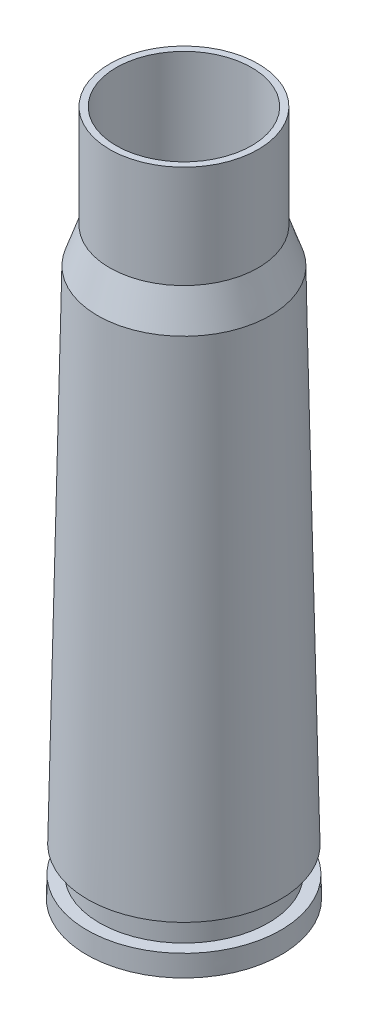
ISO-10303-21;
HEADER;
FILE_DESCRIPTION(('STEP AP214'),'2;1');
FILE_NAME('part.step','',(''),(''),'','','');
FILE_SCHEMA(('AUTOMOTIVE_DESIGN { 1 0 10303 214 1 1 1 1 }'));
ENDSEC;
DATA;
#1=APPLICATION_CONTEXT('core data for automotive mechanical design processes');
#2=APPLICATION_PROTOCOL_DEFINITION('international standard','automotive_design',2000,#1);
#3=PRODUCT_CONTEXT('',#1,'mechanical');
#4=PRODUCT('Part','Part','',(#3));
#5=PRODUCT_RELATED_PRODUCT_CATEGORY('part','',(#4));
#6=PRODUCT_DEFINITION_FORMATION('','',#4);
#7=PRODUCT_DEFINITION_CONTEXT('part definition',#1,'design');
#8=PRODUCT_DEFINITION('design','',#6,#7);
#9=PRODUCT_DEFINITION_SHAPE('','',#8);
#10=(LENGTH_UNIT() NAMED_UNIT(*) SI_UNIT(.MILLI.,.METRE.));
#11=(NAMED_UNIT(*) PLANE_ANGLE_UNIT() SI_UNIT($,.RADIAN.));
#12=(NAMED_UNIT(*) SI_UNIT($,.STERADIAN.) SOLID_ANGLE_UNIT());
#13=UNCERTAINTY_MEASURE_WITH_UNIT(LENGTH_MEASURE(1.E-05),#10,'distance_accuracy_value','');
#14=(GEOMETRIC_REPRESENTATION_CONTEXT(3) GLOBAL_UNCERTAINTY_ASSIGNED_CONTEXT((#13)) GLOBAL_UNIT_ASSIGNED_CONTEXT((#10,
#11,#12)) REPRESENTATION_CONTEXT('',''));
#15=CARTESIAN_POINT('',(0.,0.,0.));
#16=DIRECTION('',(0.,0.,1.));
#17=DIRECTION('',(1.,0.,0.));
#18=AXIS2_PLACEMENT_3D('',#15,#16,#17);
#19=CARTESIAN_POINT('',(0.,79.1275030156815,0.));
#20=DIRECTION('',(0.,-1.,0.));
#21=DIRECTION('',(0.,0.,-1.));
#22=AXIS2_PLACEMENT_3D('',#19,#20,#21);
#23=CYLINDRICAL_SURFACE('',#22,2.5);
#24=CARTESIAN_POINT('',(0.,76.6275030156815,0.));
#25=DIRECTION('',(0.,-1.,0.));
#26=DIRECTION('',(0.,0.,-1.));
#27=AXIS2_PLACEMENT_3D('',#24,#25,#26);
#28=CIRCLE('',#27,2.5);
#29=CARTESIAN_POINT('',(0.,76.6275030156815,-2.5));
#30=VERTEX_POINT('',#29);
#31=EDGE_CURVE('E87',#30,#30,#28,.F.);
#32=ORIENTED_EDGE('',*,*,#31,.T.);
#33=EDGE_LOOP('',(#32));
#34=FACE_BOUND('',#33,.T.);
#35=CARTESIAN_POINT('',(0.,79.1275030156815,0.));
#36=DIRECTION('',(0.,-1.,0.));
#37=DIRECTION('',(0.,0.,-1.));
#38=AXIS2_PLACEMENT_3D('',#35,#36,#37);
#39=CIRCLE('',#38,2.5);
#40=CARTESIAN_POINT('',(0.,79.1275030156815,-2.5));
#41=VERTEX_POINT('',#40);
#42=EDGE_CURVE('E18',#41,#41,#39,.F.);
#43=ORIENTED_EDGE('',*,*,#42,.F.);
#44=EDGE_LOOP('',(#43));
#45=FACE_BOUND('',#44,.T.);
#46=ADVANCED_FACE('F15',(#34,#45),#23,.T.);
#47=CARTESIAN_POINT('',(0.,79.1275030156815,0.));
#48=DIRECTION('',(0.,1.,0.));
#49=DIRECTION('',(0.,0.,1.));
#50=AXIS2_PLACEMENT_3D('',#47,#48,#49);
#51=PLANE('',#50);
#52=CARTESIAN_POINT('',(0.,79.1275030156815,0.));
#53=DIRECTION('',(0.,1.,0.));
#54=DIRECTION('',(0.,0.,1.));
#55=AXIS2_PLACEMENT_3D('',#52,#53,#54);
#56=CIRCLE('',#55,2.25);
#57=CARTESIAN_POINT('',(0.,79.1275030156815,2.25));
#58=VERTEX_POINT('',#57);
#59=EDGE_CURVE('E85',#58,#58,#56,.F.);
#60=ORIENTED_EDGE('',*,*,#59,.T.);
#61=EDGE_LOOP('',(#60));
#62=FACE_BOUND('',#61,.T.);
#63=ORIENTED_EDGE('',*,*,#42,.T.);
#64=EDGE_LOOP('',(#63));
#65=FACE_BOUND('',#64,.T.);
#66=ADVANCED_FACE('F94',(#62,#65),#51,.T.);
#67=CARTESIAN_POINT('',(0.,76.6275030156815,3.92966095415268));
#68=DIRECTION('',(0.,-1.,0.));
#69=DIRECTION('',(0.,0.,-1.));
#70=AXIS2_PLACEMENT_3D('',#67,#68,#69);
#71=PLANE('',#70);
#72=ORIENTED_EDGE('',*,*,#31,.F.);
#73=EDGE_LOOP('',(#72));
#74=FACE_BOUND('',#73,.T.);
#75=CARTESIAN_POINT('',(0.,76.6275030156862,0.));
#76=DIRECTION('',(0.,1.,0.));
#77=DIRECTION('',(0.,0.,1.));
#78=AXIS2_PLACEMENT_3D('',#75,#76,#77);
#79=CIRCLE('',#78,3.92966095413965);
#80=CARTESIAN_POINT('',(0.,76.6275030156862,3.92966095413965));
#81=VERTEX_POINT('',#80);
#82=EDGE_CURVE('E82',#81,#81,#79,.T.);
#83=ORIENTED_EDGE('',*,*,#82,.T.);
#84=EDGE_LOOP('',(#83));
#85=FACE_BOUND('',#84,.T.);
#86=ADVANCED_FACE('F101',(#74,#85),#71,.F.);
#87=CARTESIAN_POINT('',(0.,74.8275030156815,0.));
#88=DIRECTION('',(0.,1.,0.));
#89=DIRECTION('',(0.,0.,1.));
#90=AXIS2_PLACEMENT_3D('',#87,#88,#89);
#91=CYLINDRICAL_SURFACE('',#90,2.25);
#92=CARTESIAN_POINT('',(0.,75.0275030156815,0.));
#93=DIRECTION('',(0.,1.,0.));
#94=DIRECTION('',(0.,0.,1.));
#95=AXIS2_PLACEMENT_3D('',#92,#93,#94);
#96=CIRCLE('',#95,2.25);
#97=CARTESIAN_POINT('',(0.,75.0275030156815,2.25));
#98=VERTEX_POINT('',#97);
#99=EDGE_CURVE('E60',#98,#98,#96,.T.);
#100=ORIENTED_EDGE('',*,*,#99,.F.);
#101=EDGE_LOOP('',(#100));
#102=FACE_BOUND('',#101,.T.);
#103=ORIENTED_EDGE('',*,*,#59,.F.);
#104=EDGE_LOOP('',(#103));
#105=FACE_BOUND('',#104,.T.);
#106=ADVANCED_FACE('F165',(#102,#105),#91,.F.);
#107=CARTESIAN_POINT('',(0.,78.1131638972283,0.));
#108=DIRECTION('',(0.,1.,0.));
#109=DIRECTION('',(0.,0.,1.));
#110=AXIS2_PLACEMENT_3D('',#107,#108,#109);
#111=CONICAL_SURFACE('',#110,4.28325681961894,0.233658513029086);
#112=CARTESIAN_POINT('',(0.,78.1131638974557,0.));
#113=DIRECTION('',(0.,1.,0.));
#114=DIRECTION('',(0.,0.,-1.));
#115=AXIS2_PLACEMENT_3D('',#112,#113,#114);
#116=CIRCLE('',#115,4.28325681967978);
#117=CARTESIAN_POINT('',(0.,78.1131638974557,-4.28325681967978));
#118=VERTEX_POINT('',#117);
#119=EDGE_CURVE('E57',#118,#118,#116,.T.);
#120=ORIENTED_EDGE('',*,*,#119,.T.);
#121=EDGE_LOOP('',(#120));
#122=FACE_BOUND('',#121,.T.);
#123=ORIENTED_EDGE('',*,*,#82,.F.);
#124=EDGE_LOOP('',(#123));
#125=FACE_BOUND('',#124,.T.);
#126=ADVANCED_FACE('F161',(#122,#125),#111,.F.);
#127=CARTESIAN_POINT('',(0.,75.0275030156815,0.));
#128=DIRECTION('',(0.,-1.,0.));
#129=DIRECTION('',(0.,0.,-1.));
#130=AXIS2_PLACEMENT_3D('',#127,#128,#129);
#131=PLANE('',#130);
#132=ORIENTED_EDGE('',*,*,#99,.T.);
#133=EDGE_LOOP('',(#132));
#134=FACE_BOUND('',#133,.T.);
#135=CARTESIAN_POINT('',(0.,75.0275030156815,0.));
#136=DIRECTION('',(0.,-1.,0.));
#137=DIRECTION('',(0.,0.,-1.));
#138=AXIS2_PLACEMENT_3D('',#135,#136,#137);
#139=CIRCLE('',#138,2.35);
#140=CARTESIAN_POINT('',(0.,75.0275030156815,-2.35));
#141=VERTEX_POINT('',#140);
#142=EDGE_CURVE('E54',#141,#141,#139,.T.);
#143=ORIENTED_EDGE('',*,*,#142,.T.);
#144=EDGE_LOOP('',(#143));
#145=FACE_BOUND('',#144,.T.);
#146=ADVANCED_FACE('F157',(#134,#145),#131,.T.);
#147=CARTESIAN_POINT('',(0.,105.989545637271,0.));
#148=DIRECTION('',(0.,1.,0.));
#149=DIRECTION('',(0.,0.,1.));
#150=AXIS2_PLACEMENT_3D('',#147,#148,#149);
#151=CONICAL_SURFACE('',#150,4.38056414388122,0.00349065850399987);
#152=CARTESIAN_POINT('',(0.,105.989545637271,0.));
#153=DIRECTION('',(0.,-1.,0.));
#154=DIRECTION('',(0.,0.,1.));
#155=AXIS2_PLACEMENT_3D('',#152,#153,#154);
#156=CIRCLE('',#155,4.38056414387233);
#157=CARTESIAN_POINT('',(0.,105.989545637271,4.38056414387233));
#158=VERTEX_POINT('',#157);
#159=EDGE_CURVE('E51',#158,#158,#156,.F.);
#160=ORIENTED_EDGE('',*,*,#159,.T.);
#161=EDGE_LOOP('',(#160));
#162=FACE_BOUND('',#161,.T.);
#163=ORIENTED_EDGE('',*,*,#119,.F.);
#164=EDGE_LOOP('',(#163));
#165=FACE_BOUND('',#164,.T.);
#166=ADVANCED_FACE('F153',(#162,#165),#151,.F.);
#167=CARTESIAN_POINT('',(0.,75.0275030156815,0.));
#168=DIRECTION('',(0.,-1.,0.));
#169=DIRECTION('',(0.,0.,-1.));
#170=AXIS2_PLACEMENT_3D('',#167,#168,#169);
#171=CYLINDRICAL_SURFACE('',#170,2.35);
#172=CARTESIAN_POINT('',(0.,74.8275030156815,0.));
#173=DIRECTION('',(0.,-1.,0.));
#174=DIRECTION('',(0.,0.,-1.));
#175=AXIS2_PLACEMENT_3D('',#172,#173,#174);
#176=CIRCLE('',#175,2.35);
#177=CARTESIAN_POINT('',(0.,74.8275030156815,-2.35));
#178=VERTEX_POINT('',#177);
#179=EDGE_CURVE('E48',#178,#178,#176,.T.);
#180=ORIENTED_EDGE('',*,*,#179,.T.);
#181=EDGE_LOOP('',(#180));
#182=FACE_BOUND('',#181,.T.);
#183=ORIENTED_EDGE('',*,*,#142,.F.);
#184=EDGE_LOOP('',(#183));
#185=FACE_BOUND('',#184,.T.);
#186=ADVANCED_FACE('F149',(#182,#185),#171,.F.);
#187=CARTESIAN_POINT('',(0.,105.989545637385,0.));
#188=DIRECTION('',(0.,-1.,0.));
#189=DIRECTION('',(0.,0.,-1.));
#190=AXIS2_PLACEMENT_3D('',#187,#188,#189);
#191=CONICAL_SURFACE('',#190,4.38056414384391,0.329272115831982);
#192=CARTESIAN_POINT('',(0.,107.540333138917,0.));
#193=DIRECTION('',(0.,1.,0.));
#194=DIRECTION('',(0.,0.,1.));
#195=AXIS2_PLACEMENT_3D('',#192,#193,#194);
#196=CIRCLE('',#195,3.85064177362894);
#197=CARTESIAN_POINT('',(0.,107.540333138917,3.85064177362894));
#198=VERTEX_POINT('',#197);
#199=EDGE_CURVE('E44',#198,#198,#196,.T.);
#200=ORIENTED_EDGE('',*,*,#199,.T.);
#201=EDGE_LOOP('',(#200));
#202=FACE_BOUND('',#201,.T.);
#203=ORIENTED_EDGE('',*,*,#159,.F.);
#204=EDGE_LOOP('',(#203));
#205=FACE_BOUND('',#204,.T.);
#206=ADVANCED_FACE('F145',(#202,#205),#191,.F.);
#207=CARTESIAN_POINT('',(0.,74.8275030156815,0.));
#208=DIRECTION('',(0.,1.,0.));
#209=DIRECTION('',(0.,0.,1.));
#210=AXIS2_PLACEMENT_3D('',#207,#208,#209);
#211=PLANE('',#210);
#212=ORIENTED_EDGE('',*,*,#179,.F.);
#213=EDGE_LOOP('',(#212));
#214=FACE_BOUND('',#213,.T.);
#215=CARTESIAN_POINT('',(0.,74.8275030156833,0.));
#216=DIRECTION('',(0.,-1.,0.));
#217=DIRECTION('',(0.,0.,-1.));
#218=AXIS2_PLACEMENT_3D('',#215,#216,#217);
#219=CIRCLE('',#218,5.5347161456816);
#220=CARTESIAN_POINT('',(0.,74.8275030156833,-5.5347161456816));
#221=VERTEX_POINT('',#220);
#222=EDGE_CURVE('E47',#221,#221,#219,.F.);
#223=ORIENTED_EDGE('',*,*,#222,.F.);
#224=EDGE_LOOP('',(#223));
#225=FACE_BOUND('',#224,.T.);
#226=ADVANCED_FACE('F141',(#214,#225),#211,.F.);
#227=CARTESIAN_POINT('',(0.,74.8275030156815,0.));
#228=DIRECTION('',(0.,1.,0.));
#229=DIRECTION('',(0.,0.,1.));
#230=AXIS2_PLACEMENT_3D('',#227,#228,#229);
#231=CYLINDRICAL_SURFACE('',#230,3.85064177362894);
#232=CARTESIAN_POINT('',(0.,113.830317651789,0.));
#233=DIRECTION('',(0.,1.,0.));
#234=DIRECTION('',(0.,0.,1.));
#235=AXIS2_PLACEMENT_3D('',#232,#233,#234);
#236=CIRCLE('',#235,3.85064177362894);
#237=CARTESIAN_POINT('',(0.,113.830317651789,3.85064177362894));
#238=VERTEX_POINT('',#237);
#239=EDGE_CURVE('E71',#238,#238,#236,.T.);
#240=ORIENTED_EDGE('',*,*,#239,.T.);
#241=EDGE_LOOP('',(#240));
#242=FACE_BOUND('',#241,.T.);
#243=ORIENTED_EDGE('',*,*,#199,.F.);
#244=EDGE_LOOP('',(#243));
#245=FACE_BOUND('',#244,.T.);
#246=ADVANCED_FACE('F137',(#242,#245),#231,.F.);
#247=CARTESIAN_POINT('',(0.,74.8275030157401,0.));
#248=DIRECTION('',(0.,-1.,0.));
#249=DIRECTION('',(0.,0.,-1.));
#250=AXIS2_PLACEMENT_3D('',#247,#248,#249);
#251=CONICAL_SURFACE('',#250,5.53471614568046,0.0200783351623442);
#252=ORIENTED_EDGE('',*,*,#222,.T.);
#253=EDGE_LOOP('',(#252));
#254=FACE_BOUND('',#253,.T.);
#255=CARTESIAN_POINT('',(0.,76.0275030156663,0.));
#256=DIRECTION('',(0.,-1.,0.));
#257=DIRECTION('',(0.,0.,-1.));
#258=AXIS2_PLACEMENT_3D('',#255,#256,#257);
#259=CIRCLE('',#258,5.5106189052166);
#260=CARTESIAN_POINT('',(0.,76.0275030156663,-5.5106189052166));
#261=VERTEX_POINT('',#260);
#262=EDGE_CURVE('E68',#261,#261,#259,.T.);
#263=ORIENTED_EDGE('',*,*,#262,.T.);
#264=EDGE_LOOP('',(#263));
#265=FACE_BOUND('',#264,.T.);
#266=ADVANCED_FACE('F133',(#254,#265),#251,.T.);
#267=CARTESIAN_POINT('',(0.,113.830317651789,4.22195416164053));
#268=DIRECTION('',(0.,-1.,0.));
#269=DIRECTION('',(0.,0.,-1.));
#270=AXIS2_PLACEMENT_3D('',#267,#268,#269);
#271=PLANE('',#270);
#272=ORIENTED_EDGE('',*,*,#239,.F.);
#273=EDGE_LOOP('',(#272));
#274=FACE_BOUND('',#273,.T.);
#275=CARTESIAN_POINT('',(0.,113.830317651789,0.));
#276=DIRECTION('',(0.,1.,0.));
#277=DIRECTION('',(0.,0.,1.));
#278=AXIS2_PLACEMENT_3D('',#275,#276,#277);
#279=CIRCLE('',#278,4.22195416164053);
#280=CARTESIAN_POINT('',(0.,113.830317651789,4.22195416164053));
#281=VERTEX_POINT('',#280);
#282=EDGE_CURVE('E65',#281,#281,#279,.F.);
#283=ORIENTED_EDGE('',*,*,#282,.F.);
#284=EDGE_LOOP('',(#283));
#285=FACE_BOUND('',#284,.T.);
#286=ADVANCED_FACE('F129',(#274,#285),#271,.F.);
#287=CARTESIAN_POINT('',(0.,76.0275030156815,5.51061890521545));
#288=DIRECTION('',(0.,-1.,0.));
#289=DIRECTION('',(0.,0.,-1.));
#290=AXIS2_PLACEMENT_3D('',#287,#288,#289);
#291=PLANE('',#290);
#292=CARTESIAN_POINT('',(0.,76.0275030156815,0.));
#293=DIRECTION('',(0.,1.,0.));
#294=DIRECTION('',(0.,0.,1.));
#295=AXIS2_PLACEMENT_3D('',#292,#293,#294);
#296=CIRCLE('',#295,4.8);
#297=CARTESIAN_POINT('',(0.,76.0275030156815,4.8));
#298=VERTEX_POINT('',#297);
#299=EDGE_CURVE('E41',#298,#298,#296,.T.);
#300=ORIENTED_EDGE('',*,*,#299,.F.);
#301=EDGE_LOOP('',(#300));
#302=FACE_BOUND('',#301,.T.);
#303=ORIENTED_EDGE('',*,*,#262,.F.);
#304=EDGE_LOOP('',(#303));
#305=FACE_BOUND('',#304,.T.);
#306=ADVANCED_FACE('F125',(#302,#305),#291,.F.);
#307=CARTESIAN_POINT('',(0.,74.8275030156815,0.));
#308=DIRECTION('',(0.,1.,0.));
#309=DIRECTION('',(0.,0.,1.));
#310=AXIS2_PLACEMENT_3D('',#307,#308,#309);
#311=CYLINDRICAL_SURFACE('',#310,4.22195416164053);
#312=CARTESIAN_POINT('',(0.,108.000000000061,0.));
#313=DIRECTION('',(0.,-1.,0.));
#314=DIRECTION('',(0.,0.,1.));
#315=AXIS2_PLACEMENT_3D('',#312,#313,#314);
#316=CIRCLE('',#315,4.22195416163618);
#317=CARTESIAN_POINT('',(0.,108.000000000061,4.22195416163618));
#318=VERTEX_POINT('',#317);
#319=EDGE_CURVE('E36',#318,#318,#316,.T.);
#320=ORIENTED_EDGE('',*,*,#319,.F.);
#321=EDGE_LOOP('',(#320));
#322=FACE_BOUND('',#321,.T.);
#323=ORIENTED_EDGE('',*,*,#282,.T.);
#324=EDGE_LOOP('',(#323));
#325=FACE_BOUND('',#324,.T.);
#326=ADVANCED_FACE('F121',(#322,#325),#311,.T.);
#327=CARTESIAN_POINT('',(0.,74.8275030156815,0.));
#328=DIRECTION('',(0.,1.,0.));
#329=DIRECTION('',(0.,0.,1.));
#330=AXIS2_PLACEMENT_3D('',#327,#328,#329);
#331=CYLINDRICAL_SURFACE('',#330,4.8);
#332=ORIENTED_EDGE('',*,*,#299,.T.);
#333=EDGE_LOOP('',(#332));
#334=FACE_BOUND('',#333,.T.);
#335=CARTESIAN_POINT('',(0.,77.2275030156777,0.));
#336=DIRECTION('',(0.,1.,0.));
#337=DIRECTION('',(0.,0.,-1.));
#338=AXIS2_PLACEMENT_3D('',#335,#336,#337);
#339=CIRCLE('',#338,4.79999999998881);
#340=CARTESIAN_POINT('',(0.,77.2275030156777,-4.79999999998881));
#341=VERTEX_POINT('',#340);
#342=EDGE_CURVE('E27',#341,#341,#339,.T.);
#343=ORIENTED_EDGE('',*,*,#342,.F.);
#344=EDGE_LOOP('',(#343));
#345=FACE_BOUND('',#344,.T.);
#346=ADVANCED_FACE('F117',(#334,#345),#331,.T.);
#347=CARTESIAN_POINT('',(0.,105.989545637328,0.));
#348=DIRECTION('',(0.,-1.,0.));
#349=DIRECTION('',(1.,0.,0.));
#350=AXIS2_PLACEMENT_3D('',#347,#348,#349);
#351=CONICAL_SURFACE('',#350,4.90895011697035,0.329272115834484);
#352=CARTESIAN_POINT('',(0.,105.989545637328,0.));
#353=DIRECTION('',(0.,-1.,0.));
#354=DIRECTION('',(0.,0.,1.));
#355=AXIS2_PLACEMENT_3D('',#352,#353,#354);
#356=CIRCLE('',#355,4.90895011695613);
#357=CARTESIAN_POINT('',(0.,105.989545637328,4.90895011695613));
#358=VERTEX_POINT('',#357);
#359=EDGE_CURVE('E22',#358,#358,#356,.T.);
#360=ORIENTED_EDGE('',*,*,#359,.F.);
#361=EDGE_LOOP('',(#360));
#362=FACE_BOUND('',#361,.T.);
#363=ORIENTED_EDGE('',*,*,#319,.T.);
#364=EDGE_LOOP('',(#363));
#365=FACE_BOUND('',#364,.T.);
#366=ADVANCED_FACE('F110',(#362,#365),#351,.T.);
#367=CARTESIAN_POINT('',(0.,77.5275030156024,0.));
#368=DIRECTION('',(0.,1.,0.));
#369=DIRECTION('',(0.,0.,1.));
#370=AXIS2_PLACEMENT_3D('',#367,#368,#369);
#371=CONICAL_SURFACE('',#370,5.48049735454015,1.1555741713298);
#372=ORIENTED_EDGE('',*,*,#342,.T.);
#373=EDGE_LOOP('',(#372));
#374=FACE_BOUND('',#373,.T.);
#375=CARTESIAN_POINT('',(0.,77.5275030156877,0.));
#376=DIRECTION('',(0.,-1.,0.));
#377=DIRECTION('',(0.,0.,1.));
#378=AXIS2_PLACEMENT_3D('',#375,#376,#377);
#379=CIRCLE('',#378,5.48049735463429);
#380=CARTESIAN_POINT('',(0.,77.5275030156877,5.48049735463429));
#381=VERTEX_POINT('',#380);
#382=EDGE_CURVE('E10',#381,#381,#379,.F.);
#383=ORIENTED_EDGE('',*,*,#382,.F.);
#384=EDGE_LOOP('',(#383));
#385=FACE_BOUND('',#384,.T.);
#386=ADVANCED_FACE('F105',(#374,#385),#371,.T.);
#387=CARTESIAN_POINT('',(0.,77.5275030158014,0.));
#388=DIRECTION('',(0.,-1.,0.));
#389=DIRECTION('',(0.,0.,-1.));
#390=AXIS2_PLACEMENT_3D('',#387,#388,#389);
#391=CONICAL_SURFACE('',#390,5.48049735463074,0.0200783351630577);
#392=ORIENTED_EDGE('',*,*,#382,.T.);
#393=EDGE_LOOP('',(#392));
#394=FACE_BOUND('',#393,.T.);
#395=ORIENTED_EDGE('',*,*,#359,.T.);
#396=EDGE_LOOP('',(#395));
#397=FACE_BOUND('',#396,.T.);
#398=ADVANCED_FACE('F103',(#394,#397),#391,.T.);
#399=CLOSED_SHELL('',(#46,#66,#86,#106,#126,#146,#166,#186,#206,#226,#246,#266,#286,#306,#326,
#346,#366,#386,#398));
#400=MANIFOLD_SOLID_BREP('B1',#399);
#401=ADVANCED_BREP_SHAPE_REPRESENTATION('',(#18,#400),#14);
#402=SHAPE_DEFINITION_REPRESENTATION(#9,#401);
ENDSEC;
END-ISO-10303-21;
